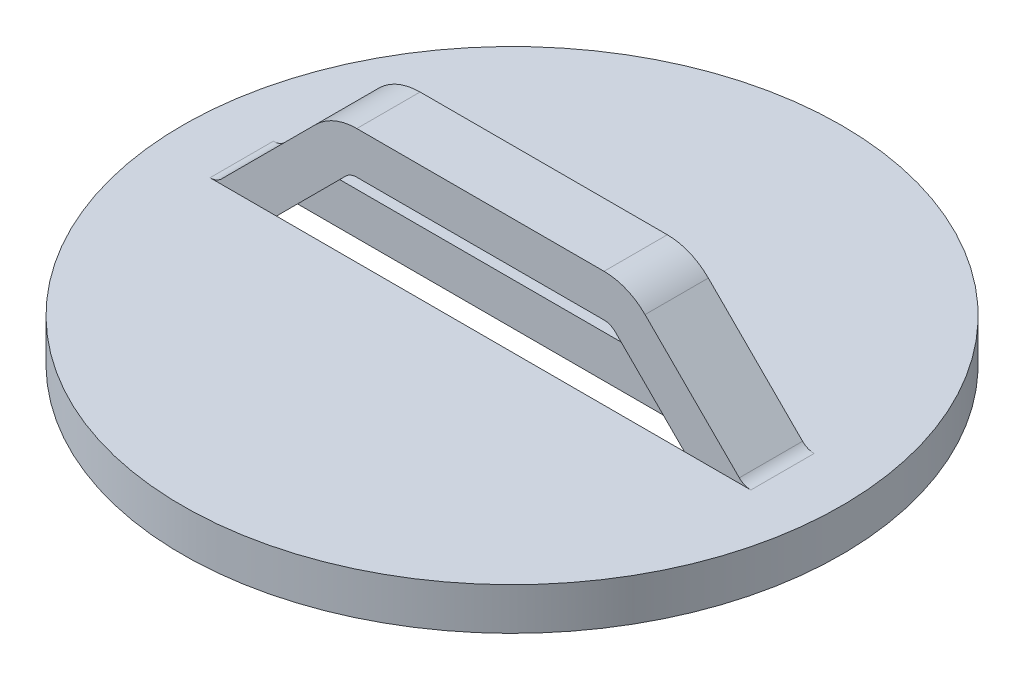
ISO-10303-21;
HEADER;
FILE_DESCRIPTION(('STEP AP214'),'2;1');
FILE_NAME('part.step','',(''),(''),'','','');
FILE_SCHEMA(('AUTOMOTIVE_DESIGN { 1 0 10303 214 1 1 1 1 }'));
ENDSEC;
DATA;
#1=APPLICATION_CONTEXT('core data for automotive mechanical design processes');
#2=APPLICATION_PROTOCOL_DEFINITION('international standard','automotive_design',2000,#1);
#3=PRODUCT_CONTEXT('',#1,'mechanical');
#4=PRODUCT('Part','Part','',(#3));
#5=PRODUCT_RELATED_PRODUCT_CATEGORY('part','',(#4));
#6=PRODUCT_DEFINITION_FORMATION('','',#4);
#7=PRODUCT_DEFINITION_CONTEXT('part definition',#1,'design');
#8=PRODUCT_DEFINITION('design','',#6,#7);
#9=PRODUCT_DEFINITION_SHAPE('','',#8);
#10=(LENGTH_UNIT() NAMED_UNIT(*) SI_UNIT(.MILLI.,.METRE.));
#11=(NAMED_UNIT(*) PLANE_ANGLE_UNIT() SI_UNIT($,.RADIAN.));
#12=(NAMED_UNIT(*) SI_UNIT($,.STERADIAN.) SOLID_ANGLE_UNIT());
#13=UNCERTAINTY_MEASURE_WITH_UNIT(LENGTH_MEASURE(1.E-05),#10,'distance_accuracy_value','');
#14=(GEOMETRIC_REPRESENTATION_CONTEXT(3) GLOBAL_UNCERTAINTY_ASSIGNED_CONTEXT((#13)) GLOBAL_UNIT_ASSIGNED_CONTEXT((#10,
#11,#12)) REPRESENTATION_CONTEXT('',''));
#15=CARTESIAN_POINT('',(0.,0.,0.));
#16=DIRECTION('',(0.,0.,1.));
#17=DIRECTION('',(1.,0.,0.));
#18=AXIS2_PLACEMENT_3D('',#15,#16,#17);
#19=CARTESIAN_POINT('',(-13.0261517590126,0.7874,0.));
#20=DIRECTION('',(0.,0.,-1.));
#21=DIRECTION('',(-1.,0.,0.));
#22=AXIS2_PLACEMENT_3D('',#19,#20,#21);
#23=PLANE('',#22);
#24=DIRECTION('',(-1.,0.,0.));
#25=VECTOR('',#24,1.);
#26=CARTESIAN_POINT('',(-13.0261517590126,0.,0.));
#27=LINE('',#26,#25);
#28=CARTESIAN_POINT('',(13.0261517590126,0.,0.));
#29=VERTEX_POINT('',#28);
#30=CARTESIAN_POINT('',(9.82631804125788,0.,0.));
#31=VERTEX_POINT('',#30);
#32=EDGE_CURVE('E53',#29,#31,#27,.T.);
#33=ORIENTED_EDGE('',*,*,#32,.F.);
#34=CARTESIAN_POINT('',(13.0261517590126,0.7874,0.));
#35=DIRECTION('',(0.,0.,1.));
#36=DIRECTION('',(1.,0.,0.));
#37=AXIS2_PLACEMENT_3D('',#34,#35,#36);
#38=CIRCLE('',#37,0.787399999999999);
#39=CARTESIAN_POINT('',(12.4693758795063,0.230624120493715,0.));
#40=VERTEX_POINT('',#39);
#41=EDGE_CURVE('E165',#29,#40,#38,.F.);
#42=ORIENTED_EDGE('',*,*,#41,.T.);
#43=DIRECTION('',(-0.707106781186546,0.707106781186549,0.));
#44=VECTOR('',#43,1.);
#45=CARTESIAN_POINT('',(7.93034365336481,4.76965634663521,0.));
#46=LINE('',#45,#44);
#47=CARTESIAN_POINT('',(7.93034365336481,4.76965634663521,0.));
#48=VERTEX_POINT('',#47);
#49=EDGE_CURVE('E196',#48,#40,#46,.F.);
#50=ORIENTED_EDGE('',*,*,#49,.F.);
#51=CARTESIAN_POINT('',(5.95468730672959,2.794,0.));
#52=DIRECTION('',(0.,0.,1.));
#53=DIRECTION('',(1.,0.,0.));
#54=AXIS2_PLACEMENT_3D('',#51,#52,#53);
#55=CIRCLE('',#54,2.794);
#56=CARTESIAN_POINT('',(5.95468730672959,5.588,0.));
#57=VERTEX_POINT('',#56);
#58=EDGE_CURVE('E200',#57,#48,#55,.F.);
#59=ORIENTED_EDGE('',*,*,#58,.F.);
#60=DIRECTION('',(1.,0.,0.));
#61=VECTOR('',#60,1.);
#62=CARTESIAN_POINT('',(-5.95468730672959,5.588,0.));
#63=LINE('',#62,#61);
#64=CARTESIAN_POINT('',(-5.95468730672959,5.588,0.));
#65=VERTEX_POINT('',#64);
#66=EDGE_CURVE('E204',#65,#57,#63,.T.);
#67=ORIENTED_EDGE('',*,*,#66,.F.);
#68=CARTESIAN_POINT('',(-5.95468730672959,2.794,0.));
#69=DIRECTION('',(0.,0.,1.));
#70=DIRECTION('',(1.,0.,0.));
#71=AXIS2_PLACEMENT_3D('',#68,#69,#70);
#72=CIRCLE('',#71,2.794);
#73=CARTESIAN_POINT('',(-7.93034365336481,4.76965634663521,0.));
#74=VERTEX_POINT('',#73);
#75=EDGE_CURVE('E208',#74,#65,#72,.F.);
#76=ORIENTED_EDGE('',*,*,#75,.F.);
#77=DIRECTION('',(-0.707106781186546,-0.707106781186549,0.));
#78=VECTOR('',#77,1.);
#79=CARTESIAN_POINT('',(-12.4693758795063,0.230624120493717,0.));
#80=LINE('',#79,#78);
#81=CARTESIAN_POINT('',(-12.4693758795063,0.230624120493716,0.));
#82=VERTEX_POINT('',#81);
#83=EDGE_CURVE('E212',#82,#74,#80,.F.);
#84=ORIENTED_EDGE('',*,*,#83,.F.);
#85=CARTESIAN_POINT('',(-13.0261517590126,0.7874,0.));
#86=DIRECTION('',(0.,0.,1.));
#87=DIRECTION('',(1.,0.,0.));
#88=AXIS2_PLACEMENT_3D('',#85,#86,#87);
#89=CIRCLE('',#88,0.787399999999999);
#90=CARTESIAN_POINT('',(-13.0261517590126,0.,0.));
#91=VERTEX_POINT('',#90);
#92=EDGE_CURVE('E216',#82,#91,#89,.F.);
#93=ORIENTED_EDGE('',*,*,#92,.T.);
#94=CARTESIAN_POINT('',(-9.82631804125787,0.,0.));
#95=VERTEX_POINT('',#94);
#96=EDGE_CURVE('E173',#95,#91,#27,.T.);
#97=ORIENTED_EDGE('',*,*,#96,.F.);
#98=DIRECTION('',(0.707106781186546,0.707106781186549,0.));
#99=VECTOR('',#98,1.);
#100=CARTESIAN_POINT('',(-11.0325349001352,-1.20621685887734,0.));
#101=LINE('',#100,#99);
#102=CARTESIAN_POINT('',(-6.49350267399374,3.33281536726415,0.));
#103=VERTEX_POINT('',#102);
#104=EDGE_CURVE('E218',#103,#95,#101,.F.);
#105=ORIENTED_EDGE('',*,*,#104,.F.);
#106=CARTESIAN_POINT('',(-5.95468730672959,2.794,0.));
#107=DIRECTION('',(0.,0.,1.));
#108=DIRECTION('',(1.,0.,0.));
#109=AXIS2_PLACEMENT_3D('',#106,#107,#108);
#110=CIRCLE('',#109,0.762);
#111=CARTESIAN_POINT('',(-5.95468730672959,3.556,0.));
#112=VERTEX_POINT('',#111);
#113=EDGE_CURVE('E222',#103,#112,#110,.F.);
#114=ORIENTED_EDGE('',*,*,#113,.T.);
#115=DIRECTION('',(1.,0.,0.));
#116=VECTOR('',#115,1.);
#117=CARTESIAN_POINT('',(-5.95468730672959,3.556,0.));
#118=LINE('',#117,#116);
#119=CARTESIAN_POINT('',(5.95468730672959,3.556,0.));
#120=VERTEX_POINT('',#119);
#121=EDGE_CURVE('E223',#120,#112,#118,.F.);
#122=ORIENTED_EDGE('',*,*,#121,.F.);
#123=CARTESIAN_POINT('',(5.95468730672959,2.794,0.));
#124=DIRECTION('',(0.,0.,1.));
#125=DIRECTION('',(1.,0.,0.));
#126=AXIS2_PLACEMENT_3D('',#123,#124,#125);
#127=CIRCLE('',#126,0.762000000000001);
#128=CARTESIAN_POINT('',(6.49350267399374,3.33281536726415,0.));
#129=VERTEX_POINT('',#128);
#130=EDGE_CURVE('E226',#120,#129,#127,.F.);
#131=ORIENTED_EDGE('',*,*,#130,.T.);
#132=DIRECTION('',(0.707106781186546,-0.707106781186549,0.));
#133=VECTOR('',#132,1.);
#134=CARTESIAN_POINT('',(6.49350267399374,3.33281536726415,0.));
#135=LINE('',#134,#133);
#136=EDGE_CURVE('E168',#31,#129,#135,.F.);
#137=ORIENTED_EDGE('',*,*,#136,.F.);
#138=EDGE_LOOP('',(#33,#42,#50,#59,#67,#76,#84,#93,#97,#105,#114,#122,#131,#137));
#139=FACE_BOUND('',#138,.T.);
#140=ADVANCED_FACE('F39',(#139),#23,.F.);
#141=CARTESIAN_POINT('',(-13.0261517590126,0.7874,-3.048));
#142=DIRECTION('',(0.,0.,-1.));
#143=DIRECTION('',(-1.,0.,0.));
#144=AXIS2_PLACEMENT_3D('',#141,#142,#143);
#145=PLANE('',#144);
#146=CARTESIAN_POINT('',(13.0261517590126,0.7874,-3.048));
#147=DIRECTION('',(0.,0.,1.));
#148=DIRECTION('',(1.,0.,0.));
#149=AXIS2_PLACEMENT_3D('',#146,#147,#148);
#150=CIRCLE('',#149,0.787399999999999);
#151=CARTESIAN_POINT('',(12.4693758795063,0.230624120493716,-3.048));
#152=VERTEX_POINT('',#151);
#153=CARTESIAN_POINT('',(13.0261517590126,0.,-3.048));
#154=VERTEX_POINT('',#153);
#155=EDGE_CURVE('E250',#152,#154,#150,.T.);
#156=ORIENTED_EDGE('',*,*,#155,.T.);
#157=DIRECTION('',(-1.,0.,0.));
#158=VECTOR('',#157,1.);
#159=CARTESIAN_POINT('',(-13.0261517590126,0.,-3.048));
#160=LINE('',#159,#158);
#161=CARTESIAN_POINT('',(9.82631804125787,0.,-3.048));
#162=VERTEX_POINT('',#161);
#163=EDGE_CURVE('E11',#154,#162,#160,.T.);
#164=ORIENTED_EDGE('',*,*,#163,.T.);
#165=DIRECTION('',(-0.707106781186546,0.707106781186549,0.));
#166=VECTOR('',#165,1.);
#167=CARTESIAN_POINT('',(11.0325349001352,-1.20621685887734,-3.048));
#168=LINE('',#167,#166);
#169=CARTESIAN_POINT('',(6.49350267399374,3.33281536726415,-3.048));
#170=VERTEX_POINT('',#169);
#171=EDGE_CURVE('E249',#162,#170,#168,.T.);
#172=ORIENTED_EDGE('',*,*,#171,.T.);
#173=CARTESIAN_POINT('',(5.95468730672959,2.794,-3.048));
#174=DIRECTION('',(0.,0.,1.));
#175=DIRECTION('',(1.,0.,0.));
#176=AXIS2_PLACEMENT_3D('',#173,#174,#175);
#177=CIRCLE('',#176,0.762000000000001);
#178=CARTESIAN_POINT('',(5.95468730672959,3.556,-3.048));
#179=VERTEX_POINT('',#178);
#180=EDGE_CURVE('E242',#170,#179,#177,.T.);
#181=ORIENTED_EDGE('',*,*,#180,.T.);
#182=DIRECTION('',(-1.,0.,0.));
#183=VECTOR('',#182,1.);
#184=CARTESIAN_POINT('',(-13.0261517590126,3.556,-3.048));
#185=LINE('',#184,#183);
#186=CARTESIAN_POINT('',(-5.95468730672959,3.556,-3.048));
#187=VERTEX_POINT('',#186);
#188=EDGE_CURVE('E241',#179,#187,#185,.T.);
#189=ORIENTED_EDGE('',*,*,#188,.T.);
#190=CARTESIAN_POINT('',(-5.95468730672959,2.794,-3.048));
#191=DIRECTION('',(0.,0.,1.));
#192=DIRECTION('',(1.,0.,0.));
#193=AXIS2_PLACEMENT_3D('',#190,#191,#192);
#194=CIRCLE('',#193,0.762);
#195=CARTESIAN_POINT('',(-6.49350267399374,3.33281536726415,-3.048));
#196=VERTEX_POINT('',#195);
#197=EDGE_CURVE('E238',#187,#196,#194,.T.);
#198=ORIENTED_EDGE('',*,*,#197,.T.);
#199=DIRECTION('',(-0.707106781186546,-0.707106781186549,0.));
#200=VECTOR('',#199,1.);
#201=CARTESIAN_POINT('',(-6.49350267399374,3.33281536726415,-3.048));
#202=LINE('',#201,#200);
#203=CARTESIAN_POINT('',(-9.82631804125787,0.,-3.048));
#204=VERTEX_POINT('',#203);
#205=EDGE_CURVE('E237',#196,#204,#202,.T.);
#206=ORIENTED_EDGE('',*,*,#205,.T.);
#207=DIRECTION('',(1.,0.,0.));
#208=VECTOR('',#207,1.);
#209=CARTESIAN_POINT('',(-13.0261517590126,0.,-3.048));
#210=LINE('',#209,#208);
#211=CARTESIAN_POINT('',(-13.0261517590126,0.,-3.048));
#212=VERTEX_POINT('',#211);
#213=EDGE_CURVE('E285',#212,#204,#210,.T.);
#214=ORIENTED_EDGE('',*,*,#213,.F.);
#215=CARTESIAN_POINT('',(-13.0261517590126,0.7874,-3.048));
#216=DIRECTION('',(0.,0.,1.));
#217=DIRECTION('',(1.,0.,0.));
#218=AXIS2_PLACEMENT_3D('',#215,#216,#217);
#219=CIRCLE('',#218,0.787399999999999);
#220=CARTESIAN_POINT('',(-12.4693758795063,0.230624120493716,-3.048));
#221=VERTEX_POINT('',#220);
#222=EDGE_CURVE('E261',#212,#221,#219,.T.);
#223=ORIENTED_EDGE('',*,*,#222,.T.);
#224=DIRECTION('',(0.707106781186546,0.707106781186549,0.));
#225=VECTOR('',#224,1.);
#226=CARTESIAN_POINT('',(-12.4693758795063,0.230624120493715,-3.048));
#227=LINE('',#226,#225);
#228=CARTESIAN_POINT('',(-7.93034365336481,4.76965634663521,-3.048));
#229=VERTEX_POINT('',#228);
#230=EDGE_CURVE('E260',#221,#229,#227,.T.);
#231=ORIENTED_EDGE('',*,*,#230,.T.);
#232=CARTESIAN_POINT('',(-5.95468730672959,2.794,-3.048));
#233=DIRECTION('',(0.,0.,1.));
#234=DIRECTION('',(1.,0.,0.));
#235=AXIS2_PLACEMENT_3D('',#232,#233,#234);
#236=CIRCLE('',#235,2.794);
#237=CARTESIAN_POINT('',(-5.95468730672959,5.588,-3.048));
#238=VERTEX_POINT('',#237);
#239=EDGE_CURVE('E257',#229,#238,#236,.F.);
#240=ORIENTED_EDGE('',*,*,#239,.T.);
#241=DIRECTION('',(-1.,0.,0.));
#242=VECTOR('',#241,1.);
#243=CARTESIAN_POINT('',(-13.0261517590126,5.588,-3.048));
#244=LINE('',#243,#242);
#245=CARTESIAN_POINT('',(5.95468730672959,5.588,-3.048));
#246=VERTEX_POINT('',#245);
#247=EDGE_CURVE('E256',#238,#246,#244,.F.);
#248=ORIENTED_EDGE('',*,*,#247,.T.);
#249=CARTESIAN_POINT('',(5.95468730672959,2.794,-3.048));
#250=DIRECTION('',(0.,0.,1.));
#251=DIRECTION('',(1.,0.,0.));
#252=AXIS2_PLACEMENT_3D('',#249,#250,#251);
#253=CIRCLE('',#252,2.794);
#254=CARTESIAN_POINT('',(7.93034365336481,4.76965634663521,-3.048));
#255=VERTEX_POINT('',#254);
#256=EDGE_CURVE('E253',#246,#255,#253,.F.);
#257=ORIENTED_EDGE('',*,*,#256,.T.);
#258=DIRECTION('',(0.707106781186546,-0.707106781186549,0.));
#259=VECTOR('',#258,1.);
#260=CARTESIAN_POINT('',(7.93034365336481,4.76965634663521,-3.048));
#261=LINE('',#260,#259);
#262=EDGE_CURVE('E252',#255,#152,#261,.T.);
#263=ORIENTED_EDGE('',*,*,#262,.T.);
#264=EDGE_LOOP('',(#156,#164,#172,#181,#189,#198,#206,#214,#223,#231,#240,#248,#257,#263));
#265=FACE_BOUND('',#264,.T.);
#266=ADVANCED_FACE('F355',(#265),#145,.T.);
#267=CARTESIAN_POINT('',(-13.0261517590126,0.7874,-3.048));
#268=DIRECTION('',(0.,0.,1.));
#269=DIRECTION('',(1.,0.,0.));
#270=AXIS2_PLACEMENT_3D('',#267,#268,#269);
#271=CYLINDRICAL_SURFACE('',#270,0.787399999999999);
#272=DIRECTION('',(0.,0.,1.));
#273=VECTOR('',#272,1.);
#274=CARTESIAN_POINT('',(-12.4693758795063,0.230624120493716,-3.048));
#275=LINE('',#274,#273);
#276=EDGE_CURVE('E209',#221,#82,#275,.T.);
#277=ORIENTED_EDGE('',*,*,#276,.F.);
#278=ORIENTED_EDGE('',*,*,#222,.F.);
#279=DIRECTION('',(0.,0.,1.));
#280=VECTOR('',#279,1.);
#281=CARTESIAN_POINT('',(-13.0261517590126,0.,-3.048));
#282=LINE('',#281,#280);
#283=EDGE_CURVE('E213',#91,#212,#282,.F.);
#284=ORIENTED_EDGE('',*,*,#283,.F.);
#285=ORIENTED_EDGE('',*,*,#92,.F.);
#286=EDGE_LOOP('',(#277,#278,#284,#285));
#287=FACE_BOUND('',#286,.T.);
#288=ADVANCED_FACE('F283',(#287),#271,.F.);
#289=CARTESIAN_POINT('',(-12.4693758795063,0.230624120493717,-3.048));
#290=DIRECTION('',(-0.707106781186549,0.707106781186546,0.));
#291=DIRECTION('',(-0.707106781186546,-0.707106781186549,0.));
#292=AXIS2_PLACEMENT_3D('',#289,#290,#291);
#293=PLANE('',#292);
#294=ORIENTED_EDGE('',*,*,#230,.F.);
#295=ORIENTED_EDGE('',*,*,#276,.T.);
#296=ORIENTED_EDGE('',*,*,#83,.T.);
#297=DIRECTION('',(0.,0.,1.));
#298=VECTOR('',#297,1.);
#299=CARTESIAN_POINT('',(-7.93034365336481,4.76965634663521,-3.048));
#300=LINE('',#299,#298);
#301=EDGE_CURVE('E205',#229,#74,#300,.T.);
#302=ORIENTED_EDGE('',*,*,#301,.F.);
#303=EDGE_LOOP('',(#294,#295,#296,#302));
#304=FACE_BOUND('',#303,.T.);
#305=ADVANCED_FACE('F364',(#304),#293,.T.);
#306=CARTESIAN_POINT('',(-5.95468730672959,2.794,-3.048));
#307=DIRECTION('',(0.,0.,1.));
#308=DIRECTION('',(1.,0.,0.));
#309=AXIS2_PLACEMENT_3D('',#306,#307,#308);
#310=CYLINDRICAL_SURFACE('',#309,2.794);
#311=ORIENTED_EDGE('',*,*,#239,.F.);
#312=ORIENTED_EDGE('',*,*,#301,.T.);
#313=ORIENTED_EDGE('',*,*,#75,.T.);
#314=DIRECTION('',(0.,0.,1.));
#315=VECTOR('',#314,1.);
#316=CARTESIAN_POINT('',(-5.95468730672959,5.588,-3.048));
#317=LINE('',#316,#315);
#318=EDGE_CURVE('E201',#238,#65,#317,.T.);
#319=ORIENTED_EDGE('',*,*,#318,.F.);
#320=EDGE_LOOP('',(#311,#312,#313,#319));
#321=FACE_BOUND('',#320,.T.);
#322=ADVANCED_FACE('F407',(#321),#310,.T.);
#323=CARTESIAN_POINT('',(-5.95468730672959,5.588,-3.048));
#324=DIRECTION('',(0.,1.,0.));
#325=DIRECTION('',(0.,0.,1.));
#326=AXIS2_PLACEMENT_3D('',#323,#324,#325);
#327=PLANE('',#326);
#328=ORIENTED_EDGE('',*,*,#247,.F.);
#329=ORIENTED_EDGE('',*,*,#318,.T.);
#330=ORIENTED_EDGE('',*,*,#66,.T.);
#331=DIRECTION('',(0.,0.,1.));
#332=VECTOR('',#331,1.);
#333=CARTESIAN_POINT('',(5.95468730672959,5.588,-3.048));
#334=LINE('',#333,#332);
#335=EDGE_CURVE('E197',#246,#57,#334,.T.);
#336=ORIENTED_EDGE('',*,*,#335,.F.);
#337=EDGE_LOOP('',(#328,#329,#330,#336));
#338=FACE_BOUND('',#337,.T.);
#339=ADVANCED_FACE('F403',(#338),#327,.T.);
#340=CARTESIAN_POINT('',(5.95468730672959,2.794,-3.048));
#341=DIRECTION('',(0.,0.,1.));
#342=DIRECTION('',(1.,0.,0.));
#343=AXIS2_PLACEMENT_3D('',#340,#341,#342);
#344=CYLINDRICAL_SURFACE('',#343,2.794);
#345=ORIENTED_EDGE('',*,*,#256,.F.);
#346=ORIENTED_EDGE('',*,*,#335,.T.);
#347=ORIENTED_EDGE('',*,*,#58,.T.);
#348=DIRECTION('',(0.,0.,1.));
#349=VECTOR('',#348,1.);
#350=CARTESIAN_POINT('',(7.93034365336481,4.76965634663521,-3.048));
#351=LINE('',#350,#349);
#352=EDGE_CURVE('E193',#255,#48,#351,.T.);
#353=ORIENTED_EDGE('',*,*,#352,.F.);
#354=EDGE_LOOP('',(#345,#346,#347,#353));
#355=FACE_BOUND('',#354,.T.);
#356=ADVANCED_FACE('F399',(#355),#344,.T.);
#357=CARTESIAN_POINT('',(7.93034365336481,4.76965634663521,-3.048));
#358=DIRECTION('',(0.707106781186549,0.707106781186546,0.));
#359=DIRECTION('',(-0.707106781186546,0.707106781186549,0.));
#360=AXIS2_PLACEMENT_3D('',#357,#358,#359);
#361=PLANE('',#360);
#362=ORIENTED_EDGE('',*,*,#262,.F.);
#363=ORIENTED_EDGE('',*,*,#352,.T.);
#364=ORIENTED_EDGE('',*,*,#49,.T.);
#365=DIRECTION('',(0.,0.,1.));
#366=VECTOR('',#365,1.);
#367=CARTESIAN_POINT('',(12.4693758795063,0.230624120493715,-3.048));
#368=LINE('',#367,#366);
#369=EDGE_CURVE('E179',#40,#152,#368,.F.);
#370=ORIENTED_EDGE('',*,*,#369,.T.);
#371=EDGE_LOOP('',(#362,#363,#364,#370));
#372=FACE_BOUND('',#371,.T.);
#373=ADVANCED_FACE('F396',(#372),#361,.T.);
#374=CARTESIAN_POINT('',(13.0261517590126,0.7874,-3.048));
#375=DIRECTION('',(0.,0.,1.));
#376=DIRECTION('',(1.,0.,0.));
#377=AXIS2_PLACEMENT_3D('',#374,#375,#376);
#378=CYLINDRICAL_SURFACE('',#377,0.787399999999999);
#379=DIRECTION('',(0.,0.,1.));
#380=VECTOR('',#379,1.);
#381=CARTESIAN_POINT('',(13.0261517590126,0.,-3.048));
#382=LINE('',#381,#380);
#383=EDGE_CURVE('E177',#154,#29,#382,.T.);
#384=ORIENTED_EDGE('',*,*,#383,.F.);
#385=ORIENTED_EDGE('',*,*,#155,.F.);
#386=ORIENTED_EDGE('',*,*,#369,.F.);
#387=ORIENTED_EDGE('',*,*,#41,.F.);
#388=EDGE_LOOP('',(#384,#385,#386,#387));
#389=FACE_BOUND('',#388,.T.);
#390=ADVANCED_FACE('F175',(#389),#378,.F.);
#391=CARTESIAN_POINT('',(13.0261517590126,0.,-3.048));
#392=DIRECTION('',(0.,1.,0.));
#393=DIRECTION('',(0.,0.,1.));
#394=AXIS2_PLACEMENT_3D('',#391,#392,#393);
#395=PLANE('',#394);
#396=CARTESIAN_POINT('',(0.,0.,-1.524));
#397=DIRECTION('',(0.,-1.,0.));
#398=DIRECTION('',(0.,0.,-1.));
#399=AXIS2_PLACEMENT_3D('',#396,#397,#398);
#400=CIRCLE('',#399,15.875);
#401=CARTESIAN_POINT('',(0.,0.,-17.399));
#402=VERTEX_POINT('',#401);
#403=EDGE_CURVE('E294',#402,#402,#400,.T.);
#404=ORIENTED_EDGE('',*,*,#403,.F.);
#405=EDGE_LOOP('',(#404));
#406=FACE_BOUND('',#405,.T.);
#407=ORIENTED_EDGE('',*,*,#383,.T.);
#408=ORIENTED_EDGE('',*,*,#32,.T.);
#409=EDGE_CURVE('E171',#31,#95,#27,.T.);
#410=ORIENTED_EDGE('',*,*,#409,.T.);
#411=ORIENTED_EDGE('',*,*,#96,.T.);
#412=ORIENTED_EDGE('',*,*,#283,.T.);
#413=ORIENTED_EDGE('',*,*,#213,.T.);
#414=EDGE_CURVE('E170',#204,#162,#210,.T.);
#415=ORIENTED_EDGE('',*,*,#414,.T.);
#416=ORIENTED_EDGE('',*,*,#163,.F.);
#417=EDGE_LOOP('',(#407,#408,#410,#411,#412,#413,#415,#416));
#418=FACE_BOUND('',#417,.T.);
#419=ADVANCED_FACE('F182',(#406,#418),#395,.T.);
#420=CARTESIAN_POINT('',(13.0261517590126,0.7874,-3.048));
#421=DIRECTION('',(0.,0.,1.));
#422=DIRECTION('',(1.,0.,0.));
#423=AXIS2_PLACEMENT_3D('',#420,#421,#422);
#424=CYLINDRICAL_SURFACE('',#423,2.8194);
#425=CARTESIAN_POINT('',(13.0261517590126,0.7874,-3.048));
#426=DIRECTION('',(0.,0.,1.));
#427=DIRECTION('',(1.,0.,0.));
#428=AXIS2_PLACEMENT_3D('',#425,#426,#427);
#429=CIRCLE('',#428,2.8194);
#430=CARTESIAN_POINT('',(13.0261517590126,-2.032,-3.048));
#431=VERTEX_POINT('',#430);
#432=CARTESIAN_POINT('',(11.0325349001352,-1.20621685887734,-3.048));
#433=VERTEX_POINT('',#432);
#434=EDGE_CURVE('E246',#431,#433,#429,.F.);
#435=ORIENTED_EDGE('',*,*,#434,.F.);
#436=DIRECTION('',(0.,0.,1.));
#437=VECTOR('',#436,1.);
#438=CARTESIAN_POINT('',(13.0261517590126,-2.032,-3.048));
#439=LINE('',#438,#437);
#440=CARTESIAN_POINT('',(13.0261517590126,-2.032,0.));
#441=VERTEX_POINT('',#440);
#442=EDGE_CURVE('E187',#431,#441,#439,.T.);
#443=ORIENTED_EDGE('',*,*,#442,.T.);
#444=CARTESIAN_POINT('',(13.0261517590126,0.7874,0.));
#445=DIRECTION('',(0.,0.,1.));
#446=DIRECTION('',(1.,0.,0.));
#447=AXIS2_PLACEMENT_3D('',#444,#445,#446);
#448=CIRCLE('',#447,2.8194);
#449=CARTESIAN_POINT('',(11.0325349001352,-1.20621685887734,0.));
#450=VERTEX_POINT('',#449);
#451=EDGE_CURVE('E184',#441,#450,#448,.F.);
#452=ORIENTED_EDGE('',*,*,#451,.T.);
#453=DIRECTION('',(0.,0.,1.));
#454=VECTOR('',#453,1.);
#455=CARTESIAN_POINT('',(11.0325349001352,-1.20621685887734,-3.048));
#456=LINE('',#455,#454);
#457=EDGE_CURVE('E229',#433,#450,#456,.T.);
#458=ORIENTED_EDGE('',*,*,#457,.F.);
#459=EDGE_LOOP('',(#435,#443,#452,#458));
#460=FACE_BOUND('',#459,.T.);
#461=ADVANCED_FACE('F328',(#460),#424,.T.);
#462=CARTESIAN_POINT('',(6.49350267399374,3.33281536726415,-3.048));
#463=DIRECTION('',(-0.707106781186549,-0.707106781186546,0.));
#464=DIRECTION('',(0.707106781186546,-0.707106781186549,0.));
#465=AXIS2_PLACEMENT_3D('',#462,#463,#464);
#466=PLANE('',#465);
#467=EDGE_CURVE('E245',#433,#162,#168,.T.);
#468=ORIENTED_EDGE('',*,*,#467,.F.);
#469=ORIENTED_EDGE('',*,*,#457,.T.);
#470=EDGE_CURVE('E227',#450,#31,#135,.F.);
#471=ORIENTED_EDGE('',*,*,#470,.T.);
#472=ORIENTED_EDGE('',*,*,#136,.T.);
#473=DIRECTION('',(0.,0.,1.));
#474=VECTOR('',#473,1.);
#475=CARTESIAN_POINT('',(6.49350267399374,3.33281536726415,-3.048));
#476=LINE('',#475,#474);
#477=EDGE_CURVE('E272',#129,#170,#476,.F.);
#478=ORIENTED_EDGE('',*,*,#477,.T.);
#479=ORIENTED_EDGE('',*,*,#171,.F.);
#480=EDGE_LOOP('',(#468,#469,#471,#472,#478,#479));
#481=FACE_BOUND('',#480,.T.);
#482=ADVANCED_FACE('F325',(#481),#466,.T.);
#483=CARTESIAN_POINT('',(5.95468730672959,2.794,-3.048));
#484=DIRECTION('',(0.,0.,1.));
#485=DIRECTION('',(1.,0.,0.));
#486=AXIS2_PLACEMENT_3D('',#483,#484,#485);
#487=CYLINDRICAL_SURFACE('',#486,0.762000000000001);
#488=DIRECTION('',(0.,0.,-1.));
#489=VECTOR('',#488,1.);
#490=CARTESIAN_POINT('',(5.95468730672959,3.556,-3.048));
#491=LINE('',#490,#489);
#492=EDGE_CURVE('E225',#179,#120,#491,.F.);
#493=ORIENTED_EDGE('',*,*,#492,.F.);
#494=ORIENTED_EDGE('',*,*,#180,.F.);
#495=ORIENTED_EDGE('',*,*,#477,.F.);
#496=ORIENTED_EDGE('',*,*,#130,.F.);
#497=EDGE_LOOP('',(#493,#494,#495,#496));
#498=FACE_BOUND('',#497,.T.);
#499=ADVANCED_FACE('F382',(#498),#487,.F.);
#500=CARTESIAN_POINT('',(-5.95468730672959,3.556,-3.048));
#501=DIRECTION('',(0.,-1.,0.));
#502=DIRECTION('',(0.,0.,-1.));
#503=AXIS2_PLACEMENT_3D('',#500,#501,#502);
#504=PLANE('',#503);
#505=ORIENTED_EDGE('',*,*,#188,.F.);
#506=ORIENTED_EDGE('',*,*,#492,.T.);
#507=ORIENTED_EDGE('',*,*,#121,.T.);
#508=DIRECTION('',(0.,0.,1.));
#509=VECTOR('',#508,1.);
#510=CARTESIAN_POINT('',(-5.95468730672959,3.556,-3.048));
#511=LINE('',#510,#509);
#512=EDGE_CURVE('E271',#112,#187,#511,.F.);
#513=ORIENTED_EDGE('',*,*,#512,.T.);
#514=EDGE_LOOP('',(#505,#506,#507,#513));
#515=FACE_BOUND('',#514,.T.);
#516=ADVANCED_FACE('F378',(#515),#504,.T.);
#517=CARTESIAN_POINT('',(-5.95468730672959,2.794,-3.048));
#518=DIRECTION('',(0.,0.,1.));
#519=DIRECTION('',(1.,0.,0.));
#520=AXIS2_PLACEMENT_3D('',#517,#518,#519);
#521=CYLINDRICAL_SURFACE('',#520,0.762);
#522=DIRECTION('',(0.,0.,1.));
#523=VECTOR('',#522,1.);
#524=CARTESIAN_POINT('',(-6.49350267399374,3.33281536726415,-3.048));
#525=LINE('',#524,#523);
#526=EDGE_CURVE('E221',#196,#103,#525,.T.);
#527=ORIENTED_EDGE('',*,*,#526,.F.);
#528=ORIENTED_EDGE('',*,*,#197,.F.);
#529=ORIENTED_EDGE('',*,*,#512,.F.);
#530=ORIENTED_EDGE('',*,*,#113,.F.);
#531=EDGE_LOOP('',(#527,#528,#529,#530));
#532=FACE_BOUND('',#531,.T.);
#533=ADVANCED_FACE('F375',(#532),#521,.F.);
#534=CARTESIAN_POINT('',(-11.0325349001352,-1.20621685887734,-3.048));
#535=DIRECTION('',(0.707106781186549,-0.707106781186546,0.));
#536=DIRECTION('',(0.707106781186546,0.707106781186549,0.));
#537=AXIS2_PLACEMENT_3D('',#534,#535,#536);
#538=PLANE('',#537);
#539=ORIENTED_EDGE('',*,*,#205,.F.);
#540=ORIENTED_EDGE('',*,*,#526,.T.);
#541=ORIENTED_EDGE('',*,*,#104,.T.);
#542=DIRECTION('',(-0.707106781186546,-0.707106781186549,0.));
#543=VECTOR('',#542,1.);
#544=CARTESIAN_POINT('',(-11.0325349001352,-1.20621685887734,0.));
#545=LINE('',#544,#543);
#546=CARTESIAN_POINT('',(-11.0325349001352,-1.20621685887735,0.));
#547=VERTEX_POINT('',#546);
#548=EDGE_CURVE('E217',#95,#547,#545,.T.);
#549=ORIENTED_EDGE('',*,*,#548,.T.);
#550=DIRECTION('',(0.,0.,1.));
#551=VECTOR('',#550,1.);
#552=CARTESIAN_POINT('',(-11.0325349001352,-1.20621685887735,-3.048));
#553=LINE('',#552,#551);
#554=CARTESIAN_POINT('',(-11.0325349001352,-1.20621685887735,-3.048));
#555=VERTEX_POINT('',#554);
#556=EDGE_CURVE('E268',#555,#547,#553,.T.);
#557=ORIENTED_EDGE('',*,*,#556,.F.);
#558=EDGE_CURVE('E61',#204,#555,#202,.T.);
#559=ORIENTED_EDGE('',*,*,#558,.F.);
#560=EDGE_LOOP('',(#539,#540,#541,#549,#557,#559));
#561=FACE_BOUND('',#560,.T.);
#562=ADVANCED_FACE('F370',(#561),#538,.T.);
#563=CARTESIAN_POINT('',(-13.0261517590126,0.7874,-3.048));
#564=DIRECTION('',(0.,0.,1.));
#565=DIRECTION('',(1.,0.,0.));
#566=AXIS2_PLACEMENT_3D('',#563,#564,#565);
#567=CYLINDRICAL_SURFACE('',#566,2.8194);
#568=CARTESIAN_POINT('',(-13.0261517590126,0.7874,-3.048));
#569=DIRECTION('',(0.,0.,1.));
#570=DIRECTION('',(1.,0.,0.));
#571=AXIS2_PLACEMENT_3D('',#568,#569,#570);
#572=CIRCLE('',#571,2.8194);
#573=CARTESIAN_POINT('',(-13.0261517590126,-2.032,-3.048));
#574=VERTEX_POINT('',#573);
#575=EDGE_CURVE('E46',#555,#574,#572,.F.);
#576=ORIENTED_EDGE('',*,*,#575,.F.);
#577=ORIENTED_EDGE('',*,*,#556,.T.);
#578=CARTESIAN_POINT('',(-13.0261517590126,0.7874,0.));
#579=DIRECTION('',(0.,0.,1.));
#580=DIRECTION('',(1.,0.,0.));
#581=AXIS2_PLACEMENT_3D('',#578,#579,#580);
#582=CIRCLE('',#581,2.8194);
#583=CARTESIAN_POINT('',(-13.0261517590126,-2.032,0.));
#584=VERTEX_POINT('',#583);
#585=EDGE_CURVE('E265',#547,#584,#582,.F.);
#586=ORIENTED_EDGE('',*,*,#585,.T.);
#587=DIRECTION('',(0.,0.,-1.));
#588=VECTOR('',#587,1.);
#589=CARTESIAN_POINT('',(-13.0261517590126,-2.032,-3.048));
#590=LINE('',#589,#588);
#591=EDGE_CURVE('E264',#574,#584,#590,.F.);
#592=ORIENTED_EDGE('',*,*,#591,.F.);
#593=EDGE_LOOP('',(#576,#577,#586,#592));
#594=FACE_BOUND('',#593,.T.);
#595=ADVANCED_FACE('F340',(#594),#567,.T.);
#596=CARTESIAN_POINT('',(-15.875,-2.032,-3.048));
#597=DIRECTION('',(0.,-1.,0.));
#598=DIRECTION('',(0.,0.,-1.));
#599=AXIS2_PLACEMENT_3D('',#596,#597,#598);
#600=PLANE('',#599);
#601=DIRECTION('',(-1.,0.,0.));
#602=VECTOR('',#601,1.);
#603=CARTESIAN_POINT('',(-13.0261517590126,-2.032,0.));
#604=LINE('',#603,#602);
#605=EDGE_CURVE('E288',#441,#584,#604,.T.);
#606=ORIENTED_EDGE('',*,*,#605,.F.);
#607=ORIENTED_EDGE('',*,*,#442,.F.);
#608=DIRECTION('',(1.,0.,0.));
#609=VECTOR('',#608,1.);
#610=CARTESIAN_POINT('',(-13.0261517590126,-2.032,-3.048));
#611=LINE('',#610,#609);
#612=EDGE_CURVE('E286',#574,#431,#611,.T.);
#613=ORIENTED_EDGE('',*,*,#612,.F.);
#614=ORIENTED_EDGE('',*,*,#591,.T.);
#615=EDGE_LOOP('',(#606,#607,#613,#614));
#616=FACE_BOUND('',#615,.T.);
#617=CARTESIAN_POINT('',(0.,-2.032,-1.524));
#618=DIRECTION('',(0.,-1.,0.));
#619=DIRECTION('',(0.,0.,-1.));
#620=AXIS2_PLACEMENT_3D('',#617,#618,#619);
#621=CIRCLE('',#620,15.875);
#622=CARTESIAN_POINT('',(0.,-2.032,-17.399));
#623=VERTEX_POINT('',#622);
#624=EDGE_CURVE('E292',#623,#623,#621,.T.);
#625=ORIENTED_EDGE('',*,*,#624,.T.);
#626=EDGE_LOOP('',(#625));
#627=FACE_BOUND('',#626,.T.);
#628=ADVANCED_FACE('F335',(#616,#627),#600,.T.);
#629=CARTESIAN_POINT('',(0.,0.,-1.524));
#630=DIRECTION('',(0.,-1.,0.));
#631=DIRECTION('',(0.,0.,-1.));
#632=AXIS2_PLACEMENT_3D('',#629,#630,#631);
#633=CYLINDRICAL_SURFACE('',#632,15.875);
#634=ORIENTED_EDGE('',*,*,#403,.T.);
#635=EDGE_LOOP('',(#634));
#636=FACE_BOUND('',#635,.T.);
#637=ORIENTED_EDGE('',*,*,#624,.F.);
#638=EDGE_LOOP('',(#637));
#639=FACE_BOUND('',#638,.T.);
#640=ADVANCED_FACE('F345',(#636,#639),#633,.T.);
#641=CARTESIAN_POINT('',(-13.0261517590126,0.,-3.048));
#642=DIRECTION('',(0.,0.,-1.));
#643=DIRECTION('',(-1.,0.,0.));
#644=AXIS2_PLACEMENT_3D('',#641,#642,#643);
#645=PLANE('',#644);
#646=ORIENTED_EDGE('',*,*,#434,.T.);
#647=ORIENTED_EDGE('',*,*,#467,.T.);
#648=ORIENTED_EDGE('',*,*,#414,.F.);
#649=ORIENTED_EDGE('',*,*,#558,.T.);
#650=ORIENTED_EDGE('',*,*,#575,.T.);
#651=ORIENTED_EDGE('',*,*,#612,.T.);
#652=EDGE_LOOP('',(#646,#647,#648,#649,#650,#651));
#653=FACE_BOUND('',#652,.T.);
#654=ADVANCED_FACE('F342',(#653),#645,.F.);
#655=CARTESIAN_POINT('',(-13.0261517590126,0.,0.));
#656=DIRECTION('',(0.,0.,1.));
#657=DIRECTION('',(1.,0.,0.));
#658=AXIS2_PLACEMENT_3D('',#655,#656,#657);
#659=PLANE('',#658);
#660=ORIENTED_EDGE('',*,*,#451,.F.);
#661=ORIENTED_EDGE('',*,*,#605,.T.);
#662=ORIENTED_EDGE('',*,*,#585,.F.);
#663=ORIENTED_EDGE('',*,*,#548,.F.);
#664=ORIENTED_EDGE('',*,*,#409,.F.);
#665=ORIENTED_EDGE('',*,*,#470,.F.);
#666=EDGE_LOOP('',(#660,#661,#662,#663,#664,#665));
#667=FACE_BOUND('',#666,.T.);
#668=ADVANCED_FACE('F333',(#667),#659,.F.);
#669=CLOSED_SHELL('',(#140,#266,#288,#305,#322,#339,#356,#373,#390,#419,#461,#482,#499,#516,
#533,#562,#595,#628,#640,#654,#668));
#670=MANIFOLD_SOLID_BREP('B2',#669);
#671=ADVANCED_BREP_SHAPE_REPRESENTATION('',(#18,#670),#14);
#672=SHAPE_DEFINITION_REPRESENTATION(#9,#671);
ENDSEC;
END-ISO-10303-21;
